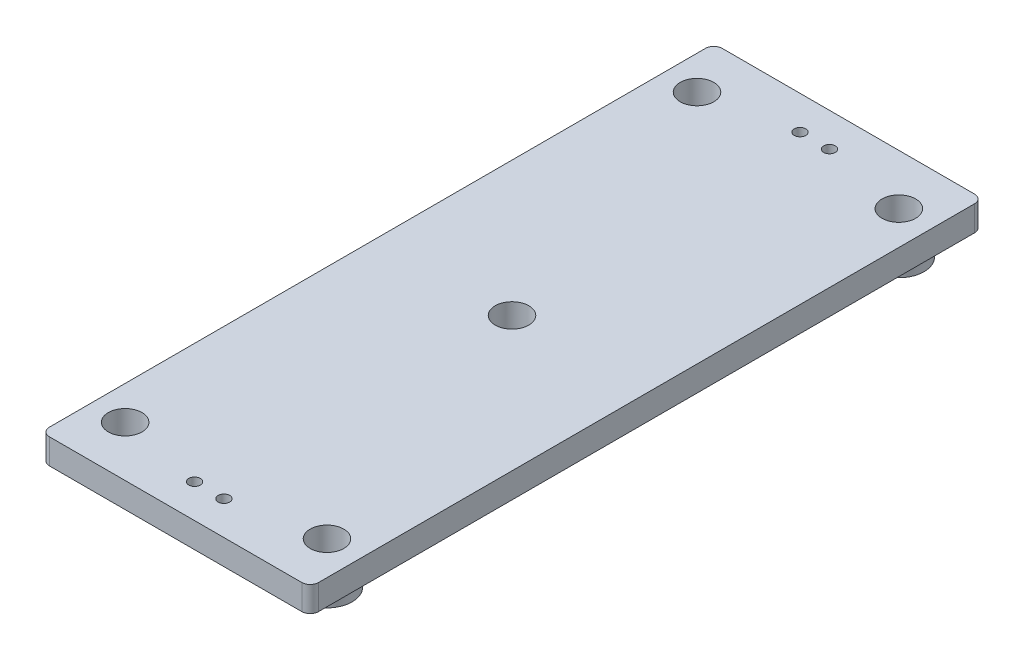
from build123d import *

# Parameters (mm, degrees)
SKETCH1_W           = 203.2
SKETCH1_H           = 508
BASE_EXTRUDE_DEPTH  = 19.05
SKETCH2_R           = 19.05
BOSS_EXTRUDE1_DEPTH = 12.7
SKETCH3_R           = 12.7
CUT_EXTRUDE1_DEPTH  = 520.032390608
SKETCH4_R           = 12.7
CUT_EXTRUDE2_DEPTH  = 520.032390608
SKETCH5_R           = 4.365625
CUT_EXTRUDE3_DEPTH  = 519.410515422
FILLET1_R           = 6.35
FILLET2_R           = 3.175


with BuildPart() as part:
    # Sketch1 → Base-Extrude (new body)
    with BuildSketch(Plane(origin=(0, 0, 0), x_dir=(1, 0, 0), z_dir=(0, 1, 0))):
        with Locations((0, -254)):
            Rectangle(SKETCH1_W, SKETCH1_H)
    extrude(amount=BASE_EXTRUDE_DEPTH)

    # Sketch2 → Boss-Extrude1 (add)
    with BuildSketch(Plane.XZ):
        with Locations(Location((76.2, 469.9, 0), (0, 0, 270))):
            Circle(SKETCH2_R)
        with Locations(Location((76.2, 38.1, 0), (0, 0, 90))):
            Circle(SKETCH2_R)
        with Locations(Location((-76.2, 38.1, 0), (0, 0, 270))):
            Circle(SKETCH2_R)
        with Locations(Location((-76.2, 469.9, 0), (0, 0, 90))):
            Circle(SKETCH2_R)
    extrude(amount=BOSS_EXTRUDE1_DEPTH)

    # Sketch3 → Cut-Extrude1 (cut, through all)
    with BuildSketch(Plane.XZ.offset(12.7)):
        with Locations(Location((76.2, 469.9, 0), (0, 0, 270))):
            Circle(SKETCH3_R)
        with Locations(Location((-76.2, 469.9, 0), (0, 0, 270))):
            Circle(SKETCH3_R)
        with Locations(Location((76.2, 38.1, 0), (0, 0, 270))):
            Circle(SKETCH3_R)
        with Locations(Location((-76.2, 38.1, 0), (0, 0, 270))):
            Circle(SKETCH3_R)
    extrude(amount=-CUT_EXTRUDE1_DEPTH, mode=Mode.SUBTRACT)

    # Sketch4 → Cut-Extrude2 (cut, through all)
    with BuildSketch(Plane(origin=(0, 19.05, 0), x_dir=(-1, 0, 0), z_dir=(0, 1, 0))):
        with Locations(Location((0, 254, 0), (0, 0, 90))):
            Circle(SKETCH4_R)
    extrude(amount=-CUT_EXTRUDE2_DEPTH, mode=Mode.SUBTRACT)

    # Sketch5 → Cut-Extrude3 (cut, through all)
    with BuildSketch(Plane.XZ):
        with Locations(Location((-11.1125, 25.4, 0), (0, 0, 270))):
            Circle(SKETCH5_R)
        with Locations(Location((11.1125, 25.4, 0), (0, 0, 270))):
            Circle(SKETCH5_R)
        with Locations(Location((11.1125, 482.6, 0), (0, 0, 270))):
            Circle(SKETCH5_R)
        with Locations(Location((-11.1125, 482.6, 0), (0, 0, 270))):
            Circle(SKETCH5_R)
    extrude(amount=-CUT_EXTRUDE3_DEPTH, mode=Mode.SUBTRACT)

    # Fillet1
    fillet1_edges = [part.edges().sort_by_distance(p)[0] for p in [
        (101.6, 9.525, 0),
        (-101.6, 9.525, 0),
        (-101.6, 9.525, 508),
        (101.6, 9.525, 508),
    ]]
    fillet(fillet1_edges, radius=FILLET1_R)

    # Fillet2
    fillet2_edges = [part.edges().sort_by_distance(p)[0] for p in [
        (76.2, 0, 488.95),
        (76.2, 0, 19.05),
        (-76.2, 0, 57.15),
        (-76.2, 0, 450.85),
    ]]
    fillet(fillet2_edges, radius=FILLET2_R)


solid = part.part
